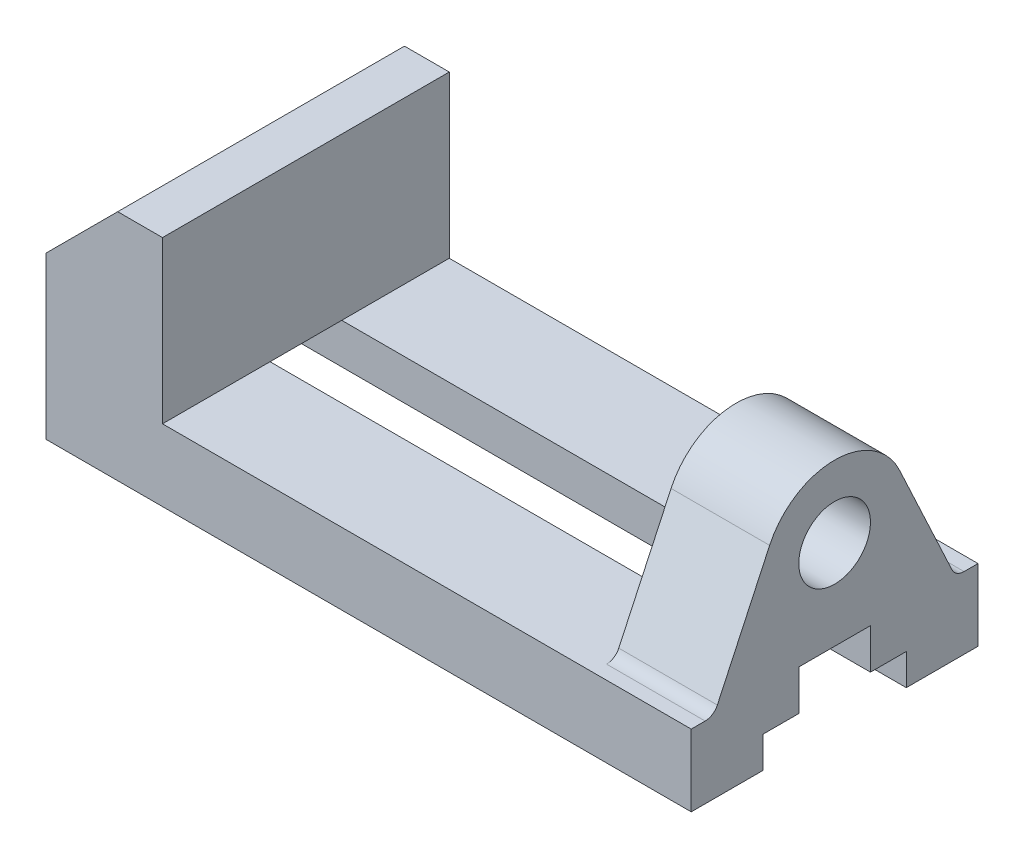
from build123d import *

# Parameters (mm, degrees)
BOSS_EXTRUDE1_DEPTH          = 32
SKETCH2_R                    = 8
BOSS_EXTRUDE2_DEPTH          = 22
FILLET1_R                    = 3
CUT_EXTRUDE1_DEPTH           = 157.409718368
F_6_0_6_DIAMETER_HOLE1_D     = 6
F_6_0_6_DIAMETER_HOLE1_DEPTH = 10
F_6_0_6_DIAMETER_HOLE1_TIP   = 1.802581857


with BuildPart() as part:
    # Sketch1 → Boss-Extrude1 (new, symmetric)
    with BuildSketch(Plane.XY):
        Polygon((0, 36), (0, 0), (144, 0), (144, 16), (26, 16), (26, 52), (16, 52), align=None)
    extrude(amount=BOSS_EXTRUDE1_DEPTH, both=True)

    # Sketch2 → Boss-Extrude2 (add)
    with BuildSketch(Plane(origin=(144, 0, 0), x_dir=(0, 0, -1), z_dir=(1, 0, 0))):
        with BuildLine():
            Line((-26.980199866, 16), (-14.500924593, 42.761892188))
            ThreePointArc((-14.500924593, 42.761892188), (0, 52), (14.500924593, 42.761892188))
            Line((14.500924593, 42.761892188), (26.980199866, 16))
            Line((26.980199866, 16), (-26.980199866, 16))
        make_face()
        with Locations((0, 36)):
            Circle(SKETCH2_R, mode=Mode.SUBTRACT)
    extrude(amount=-BOSS_EXTRUDE2_DEPTH)

    # Fillet1
    fillet1_edges = [part.edges().sort_by_distance(p)[0] for p in [
        (133, 16, -26.980199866),
        (133, 16, 26.980199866),
    ]]
    fillet(fillet1_edges, radius=FILLET1_R)

    # Sketch3 → Cut-Extrude1 (cut, through all)
    with BuildSketch(Plane(origin=(144, 0, 0), x_dir=(0, 0, -1), z_dir=(1, 0, 0))):
        Polygon((-16, 0), (-16, 7), (-8, 7), (-8, 16), (8, 16), (8, 7), (16, 7), (16, 0), align=None)
    extrude(amount=-CUT_EXTRUDE1_DEPTH, mode=Mode.SUBTRACT)

    # 6.0 _6_ Diameter Hole1
    with Locations(Plane.XZ):
        with Locations((106, -22), (36, -22), (36, 22), (106, 22)):
            Hole(F_6_0_6_DIAMETER_HOLE1_D / 2, depth=F_6_0_6_DIAMETER_HOLE1_DEPTH)
            with Locations((0, 0, -(F_6_0_6_DIAMETER_HOLE1_DEPTH + F_6_0_6_DIAMETER_HOLE1_TIP / 2))):  # 118° drill point
                Cone(0, F_6_0_6_DIAMETER_HOLE1_D / 2, F_6_0_6_DIAMETER_HOLE1_TIP, mode=Mode.SUBTRACT)


solid = part.part
